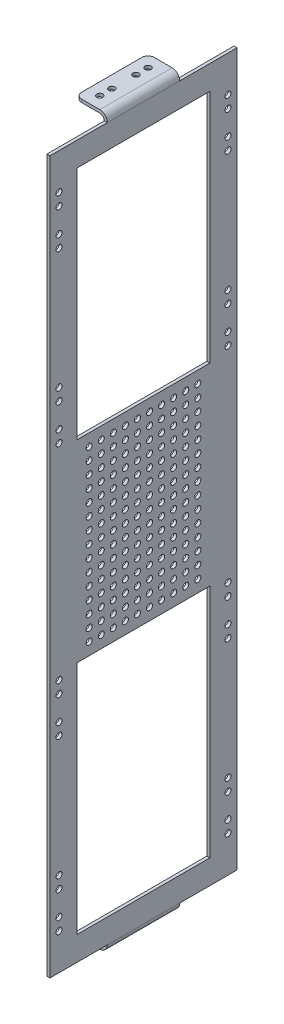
from build123d import *

# Parameters (mm, degrees)
SKETCH1_W              = 95.25
SKETCH1_H              = 374.65
MAINPLATEEXTRUDE_DEPTH = 1.5875
SKETCH4_W              = 69.85
SKETCH4_H              = 349.25
WALLOPENING_DEPTH      = 1.5875
SKETCH5_W              = 69.85
SKETCH5_H              = 101.6
SKETCH5_R              = 1.5875
ANTENNAEMOUNT_DEPTH    = 1.5875
BOSS_EXTRUDE1_DEPTH    = 19.05
MIRROR2_COPY_1_DEPTH   = 19.05
FILLET1_R              = 3.175
SKETCH8_R              = 1.5875
CUT_EXTRUDE1_DEPTH     = 382.905
SKETCH9_R              = 1.5875
CUT_EXTRUDE2_DEPTH     = 25.4
SKETCH10_W             = 1.5875
SKETCH10_H             = 374.65
BOSS_EXTRUDE2_DEPTH    = 1.5875


with BuildPart() as part:
    # Sketch1 → MainPlateExtrude (new body)
    with BuildSketch(Plane(origin=(0, 0, 0), x_dir=(0, 0, -1), z_dir=(1, 0, 0))):
        with Locations((47.625, 187.325)):
            Rectangle(SKETCH1_W, SKETCH1_H)
    extrude(amount=MAINPLATEEXTRUDE_DEPTH)

    # Sketch4 → WallOpening (cut)
    with BuildSketch(Plane.ZY):
        with Locations((-47.625, 187.325)):
            Rectangle(SKETCH4_W, SKETCH4_H)
    extrude(amount=-WALLOPENING_DEPTH, mode=Mode.SUBTRACT)

    # Sketch5 → AntennaeMount (add)
    with BuildSketch(Plane.ZY):
        with Locations((-47.625, 187.325)):
            Rectangle(SKETCH5_W, SKETCH5_H)
        with Locations((-76.2, 231.775)):
            Circle(SKETCH5_R, mode=Mode.SUBTRACT)
        with Locations((-69.85, 231.775)):
            Circle(SKETCH5_R, mode=Mode.SUBTRACT)
        with Locations((-63.5, 231.775)):
            Circle(SKETCH5_R, mode=Mode.SUBTRACT)
        with Locations((-57.15, 231.775)):
            Circle(SKETCH5_R, mode=Mode.SUBTRACT)
        with Locations((-50.8, 231.775)):
            Circle(SKETCH5_R, mode=Mode.SUBTRACT)
        with Locations((-44.45, 231.775)):
            Circle(SKETCH5_R, mode=Mode.SUBTRACT)
        with Locations((-38.1, 231.775)):
            Circle(SKETCH5_R, mode=Mode.SUBTRACT)
        with Locations((-31.75, 231.775)):
            Circle(SKETCH5_R, mode=Mode.SUBTRACT)
        with Locations((-25.4, 231.775)):
            Circle(SKETCH5_R, mode=Mode.SUBTRACT)
        with Locations((-19.05, 231.775)):
            Circle(SKETCH5_R, mode=Mode.SUBTRACT)
        with Locations((-69.85, 225.425)):
            Circle(SKETCH5_R, mode=Mode.SUBTRACT)
        with Locations((-63.5, 225.425)):
            Circle(SKETCH5_R, mode=Mode.SUBTRACT)
        with Locations((-57.15, 225.425)):
            Circle(SKETCH5_R, mode=Mode.SUBTRACT)
        with Locations((-50.8, 225.425)):
            Circle(SKETCH5_R, mode=Mode.SUBTRACT)
        with Locations((-44.45, 225.425)):
            Circle(SKETCH5_R, mode=Mode.SUBTRACT)
        with Locations((-38.1, 225.425)):
            Circle(SKETCH5_R, mode=Mode.SUBTRACT)
        with Locations((-31.75, 225.425)):
            Circle(SKETCH5_R, mode=Mode.SUBTRACT)
        with Locations((-25.4, 225.425)):
            Circle(SKETCH5_R, mode=Mode.SUBTRACT)
        with Locations((-19.05, 225.425)):
            Circle(SKETCH5_R, mode=Mode.SUBTRACT)
        with Locations((-69.85, 219.075)):
            Circle(SKETCH5_R, mode=Mode.SUBTRACT)
        with Locations((-63.5, 219.075)):
            Circle(SKETCH5_R, mode=Mode.SUBTRACT)
        with Locations((-57.15, 219.075)):
            Circle(SKETCH5_R, mode=Mode.SUBTRACT)
        with Locations((-50.8, 219.075)):
            Circle(SKETCH5_R, mode=Mode.SUBTRACT)
        with Locations((-44.45, 219.075)):
            Circle(SKETCH5_R, mode=Mode.SUBTRACT)
        with Locations((-38.1, 219.075)):
            Circle(SKETCH5_R, mode=Mode.SUBTRACT)
        with Locations((-31.75, 219.075)):
            Circle(SKETCH5_R, mode=Mode.SUBTRACT)
        with Locations((-25.4, 219.075)):
            Circle(SKETCH5_R, mode=Mode.SUBTRACT)
        with Locations((-19.05, 219.075)):
            Circle(SKETCH5_R, mode=Mode.SUBTRACT)
        with Locations((-69.85, 212.725)):
            Circle(SKETCH5_R, mode=Mode.SUBTRACT)
        with Locations((-63.5, 212.725)):
            Circle(SKETCH5_R, mode=Mode.SUBTRACT)
        with Locations((-57.15, 212.725)):
            Circle(SKETCH5_R, mode=Mode.SUBTRACT)
        with Locations((-50.8, 212.725)):
            Circle(SKETCH5_R, mode=Mode.SUBTRACT)
        with Locations((-44.45, 212.725)):
            Circle(SKETCH5_R, mode=Mode.SUBTRACT)
        with Locations((-38.1, 212.725)):
            Circle(SKETCH5_R, mode=Mode.SUBTRACT)
        with Locations((-31.75, 212.725)):
            Circle(SKETCH5_R, mode=Mode.SUBTRACT)
        with Locations((-25.4, 212.725)):
            Circle(SKETCH5_R, mode=Mode.SUBTRACT)
        with Locations((-19.05, 212.725)):
            Circle(SKETCH5_R, mode=Mode.SUBTRACT)
        with Locations((-69.85, 206.375)):
            Circle(SKETCH5_R, mode=Mode.SUBTRACT)
        with Locations((-63.5, 206.375)):
            Circle(SKETCH5_R, mode=Mode.SUBTRACT)
        with Locations((-57.15, 206.375)):
            Circle(SKETCH5_R, mode=Mode.SUBTRACT)
        with Locations((-50.8, 206.375)):
            Circle(SKETCH5_R, mode=Mode.SUBTRACT)
        with Locations((-44.45, 206.375)):
            Circle(SKETCH5_R, mode=Mode.SUBTRACT)
        with Locations((-38.1, 206.375)):
            Circle(SKETCH5_R, mode=Mode.SUBTRACT)
        with Locations((-31.75, 206.375)):
            Circle(SKETCH5_R, mode=Mode.SUBTRACT)
        with Locations((-25.4, 206.375)):
            Circle(SKETCH5_R, mode=Mode.SUBTRACT)
        with Locations((-19.05, 206.375)):
            Circle(SKETCH5_R, mode=Mode.SUBTRACT)
        with Locations((-69.85, 200.025)):
            Circle(SKETCH5_R, mode=Mode.SUBTRACT)
        with Locations((-63.5, 200.025)):
            Circle(SKETCH5_R, mode=Mode.SUBTRACT)
        with Locations((-57.15, 200.025)):
            Circle(SKETCH5_R, mode=Mode.SUBTRACT)
        with Locations((-50.8, 200.025)):
            Circle(SKETCH5_R, mode=Mode.SUBTRACT)
        with Locations((-44.45, 200.025)):
            Circle(SKETCH5_R, mode=Mode.SUBTRACT)
        with Locations((-38.1, 200.025)):
            Circle(SKETCH5_R, mode=Mode.SUBTRACT)
        with Locations((-31.75, 200.025)):
            Circle(SKETCH5_R, mode=Mode.SUBTRACT)
        with Locations((-25.4, 200.025)):
            Circle(SKETCH5_R, mode=Mode.SUBTRACT)
        with Locations((-19.05, 200.025)):
            Circle(SKETCH5_R, mode=Mode.SUBTRACT)
        with Locations((-69.85, 193.675)):
            Circle(SKETCH5_R, mode=Mode.SUBTRACT)
        with Locations((-63.5, 193.675)):
            Circle(SKETCH5_R, mode=Mode.SUBTRACT)
        with Locations((-57.15, 193.675)):
            Circle(SKETCH5_R, mode=Mode.SUBTRACT)
        with Locations((-50.8, 193.675)):
            Circle(SKETCH5_R, mode=Mode.SUBTRACT)
        with Locations((-44.45, 193.675)):
            Circle(SKETCH5_R, mode=Mode.SUBTRACT)
        with Locations((-38.1, 193.675)):
            Circle(SKETCH5_R, mode=Mode.SUBTRACT)
        with Locations((-31.75, 193.675)):
            Circle(SKETCH5_R, mode=Mode.SUBTRACT)
        with Locations((-25.4, 193.675)):
            Circle(SKETCH5_R, mode=Mode.SUBTRACT)
        with Locations((-19.05, 193.675)):
            Circle(SKETCH5_R, mode=Mode.SUBTRACT)
        with Locations((-69.85, 187.325)):
            Circle(SKETCH5_R, mode=Mode.SUBTRACT)
        with Locations((-63.5, 187.325)):
            Circle(SKETCH5_R, mode=Mode.SUBTRACT)
        with Locations((-57.15, 187.325)):
            Circle(SKETCH5_R, mode=Mode.SUBTRACT)
        with Locations((-50.8, 187.325)):
            Circle(SKETCH5_R, mode=Mode.SUBTRACT)
        with Locations((-44.45, 187.325)):
            Circle(SKETCH5_R, mode=Mode.SUBTRACT)
        with Locations((-38.1, 187.325)):
            Circle(SKETCH5_R, mode=Mode.SUBTRACT)
        with Locations((-31.75, 187.325)):
            Circle(SKETCH5_R, mode=Mode.SUBTRACT)
        with Locations((-25.4, 187.325)):
            Circle(SKETCH5_R, mode=Mode.SUBTRACT)
        with Locations((-19.05, 187.325)):
            Circle(SKETCH5_R, mode=Mode.SUBTRACT)
        with Locations((-69.85, 180.975)):
            Circle(SKETCH5_R, mode=Mode.SUBTRACT)
        with Locations((-63.5, 180.975)):
            Circle(SKETCH5_R, mode=Mode.SUBTRACT)
        with Locations((-57.15, 180.975)):
            Circle(SKETCH5_R, mode=Mode.SUBTRACT)
        with Locations((-50.8, 180.975)):
            Circle(SKETCH5_R, mode=Mode.SUBTRACT)
        with Locations((-44.45, 180.975)):
            Circle(SKETCH5_R, mode=Mode.SUBTRACT)
        with Locations((-38.1, 180.975)):
            Circle(SKETCH5_R, mode=Mode.SUBTRACT)
        with Locations((-31.75, 180.975)):
            Circle(SKETCH5_R, mode=Mode.SUBTRACT)
        with Locations((-25.4, 180.975)):
            Circle(SKETCH5_R, mode=Mode.SUBTRACT)
        with Locations((-19.05, 180.975)):
            Circle(SKETCH5_R, mode=Mode.SUBTRACT)
        with Locations((-69.85, 174.625)):
            Circle(SKETCH5_R, mode=Mode.SUBTRACT)
        with Locations((-63.5, 174.625)):
            Circle(SKETCH5_R, mode=Mode.SUBTRACT)
        with Locations((-57.15, 174.625)):
            Circle(SKETCH5_R, mode=Mode.SUBTRACT)
        with Locations((-50.8, 174.625)):
            Circle(SKETCH5_R, mode=Mode.SUBTRACT)
        with Locations((-44.45, 174.625)):
            Circle(SKETCH5_R, mode=Mode.SUBTRACT)
        with Locations((-38.1, 174.625)):
            Circle(SKETCH5_R, mode=Mode.SUBTRACT)
        with Locations((-31.75, 174.625)):
            Circle(SKETCH5_R, mode=Mode.SUBTRACT)
        with Locations((-25.4, 174.625)):
            Circle(SKETCH5_R, mode=Mode.SUBTRACT)
        with Locations((-19.05, 174.625)):
            Circle(SKETCH5_R, mode=Mode.SUBTRACT)
        with Locations((-69.85, 168.275)):
            Circle(SKETCH5_R, mode=Mode.SUBTRACT)
        with Locations((-63.5, 168.275)):
            Circle(SKETCH5_R, mode=Mode.SUBTRACT)
        with Locations((-57.15, 168.275)):
            Circle(SKETCH5_R, mode=Mode.SUBTRACT)
        with Locations((-50.8, 168.275)):
            Circle(SKETCH5_R, mode=Mode.SUBTRACT)
        with Locations((-44.45, 168.275)):
            Circle(SKETCH5_R, mode=Mode.SUBTRACT)
        with Locations((-38.1, 168.275)):
            Circle(SKETCH5_R, mode=Mode.SUBTRACT)
        with Locations((-31.75, 168.275)):
            Circle(SKETCH5_R, mode=Mode.SUBTRACT)
        with Locations((-25.4, 168.275)):
            Circle(SKETCH5_R, mode=Mode.SUBTRACT)
        with Locations((-19.05, 168.275)):
            Circle(SKETCH5_R, mode=Mode.SUBTRACT)
        with Locations((-69.85, 161.925)):
            Circle(SKETCH5_R, mode=Mode.SUBTRACT)
        with Locations((-63.5, 161.925)):
            Circle(SKETCH5_R, mode=Mode.SUBTRACT)
        with Locations((-57.15, 161.925)):
            Circle(SKETCH5_R, mode=Mode.SUBTRACT)
        with Locations((-50.8, 161.925)):
            Circle(SKETCH5_R, mode=Mode.SUBTRACT)
        with Locations((-44.45, 161.925)):
            Circle(SKETCH5_R, mode=Mode.SUBTRACT)
        with Locations((-38.1, 161.925)):
            Circle(SKETCH5_R, mode=Mode.SUBTRACT)
        with Locations((-31.75, 161.925)):
            Circle(SKETCH5_R, mode=Mode.SUBTRACT)
        with Locations((-25.4, 161.925)):
            Circle(SKETCH5_R, mode=Mode.SUBTRACT)
        with Locations((-19.05, 161.925)):
            Circle(SKETCH5_R, mode=Mode.SUBTRACT)
        with Locations((-69.85, 155.575)):
            Circle(SKETCH5_R, mode=Mode.SUBTRACT)
        with Locations((-63.5, 155.575)):
            Circle(SKETCH5_R, mode=Mode.SUBTRACT)
        with Locations((-57.15, 155.575)):
            Circle(SKETCH5_R, mode=Mode.SUBTRACT)
        with Locations((-50.8, 155.575)):
            Circle(SKETCH5_R, mode=Mode.SUBTRACT)
        with Locations((-44.45, 155.575)):
            Circle(SKETCH5_R, mode=Mode.SUBTRACT)
        with Locations((-38.1, 155.575)):
            Circle(SKETCH5_R, mode=Mode.SUBTRACT)
        with Locations((-31.75, 155.575)):
            Circle(SKETCH5_R, mode=Mode.SUBTRACT)
        with Locations((-25.4, 155.575)):
            Circle(SKETCH5_R, mode=Mode.SUBTRACT)
        with Locations((-19.05, 155.575)):
            Circle(SKETCH5_R, mode=Mode.SUBTRACT)
        with Locations((-69.85, 149.225)):
            Circle(SKETCH5_R, mode=Mode.SUBTRACT)
        with Locations((-63.5, 149.225)):
            Circle(SKETCH5_R, mode=Mode.SUBTRACT)
        with Locations((-57.15, 149.225)):
            Circle(SKETCH5_R, mode=Mode.SUBTRACT)
        with Locations((-50.8, 149.225)):
            Circle(SKETCH5_R, mode=Mode.SUBTRACT)
        with Locations((-44.45, 149.225)):
            Circle(SKETCH5_R, mode=Mode.SUBTRACT)
        with Locations((-38.1, 149.225)):
            Circle(SKETCH5_R, mode=Mode.SUBTRACT)
        with Locations((-31.75, 149.225)):
            Circle(SKETCH5_R, mode=Mode.SUBTRACT)
        with Locations((-25.4, 149.225)):
            Circle(SKETCH5_R, mode=Mode.SUBTRACT)
        with Locations((-19.05, 149.225)):
            Circle(SKETCH5_R, mode=Mode.SUBTRACT)
        with Locations((-69.85, 142.875)):
            Circle(SKETCH5_R, mode=Mode.SUBTRACT)
        with Locations((-63.5, 142.875)):
            Circle(SKETCH5_R, mode=Mode.SUBTRACT)
        with Locations((-57.15, 142.875)):
            Circle(SKETCH5_R, mode=Mode.SUBTRACT)
        with Locations((-50.8, 142.875)):
            Circle(SKETCH5_R, mode=Mode.SUBTRACT)
        with Locations((-44.45, 142.875)):
            Circle(SKETCH5_R, mode=Mode.SUBTRACT)
        with Locations((-38.1, 142.875)):
            Circle(SKETCH5_R, mode=Mode.SUBTRACT)
        with Locations((-31.75, 142.875)):
            Circle(SKETCH5_R, mode=Mode.SUBTRACT)
        with Locations((-25.4, 142.875)):
            Circle(SKETCH5_R, mode=Mode.SUBTRACT)
        with Locations((-19.05, 142.875)):
            Circle(SKETCH5_R, mode=Mode.SUBTRACT)
        with Locations((-76.2, 225.425)):
            Circle(SKETCH5_R, mode=Mode.SUBTRACT)
        with Locations((-76.2, 219.075)):
            Circle(SKETCH5_R, mode=Mode.SUBTRACT)
        with Locations((-76.2, 212.725)):
            Circle(SKETCH5_R, mode=Mode.SUBTRACT)
        with Locations((-76.2, 206.375)):
            Circle(SKETCH5_R, mode=Mode.SUBTRACT)
        with Locations((-76.2, 200.025)):
            Circle(SKETCH5_R, mode=Mode.SUBTRACT)
        with Locations((-76.2, 193.675)):
            Circle(SKETCH5_R, mode=Mode.SUBTRACT)
        with Locations((-76.2, 187.325)):
            Circle(SKETCH5_R, mode=Mode.SUBTRACT)
        with Locations((-76.2, 180.975)):
            Circle(SKETCH5_R, mode=Mode.SUBTRACT)
        with Locations((-76.2, 174.625)):
            Circle(SKETCH5_R, mode=Mode.SUBTRACT)
        with Locations((-76.2, 168.275)):
            Circle(SKETCH5_R, mode=Mode.SUBTRACT)
        with Locations((-76.2, 161.925)):
            Circle(SKETCH5_R, mode=Mode.SUBTRACT)
        with Locations((-76.2, 155.575)):
            Circle(SKETCH5_R, mode=Mode.SUBTRACT)
        with Locations((-76.2, 149.225)):
            Circle(SKETCH5_R, mode=Mode.SUBTRACT)
        with Locations((-76.2, 142.875)):
            Circle(SKETCH5_R, mode=Mode.SUBTRACT)
    extrude(amount=-ANTENNAEMOUNT_DEPTH)

    # Sketch7 → Boss-Extrude1 (add)
    with BuildSketch(Plane(origin=(0, 0, -47.625), x_dir=(-1, 0, 0), z_dir=(0, 0, -1))):
        with BuildLine():
            Line((0, 374.65), (-1.5875, 374.65))
            ThreePointArc((-1.5875, 374.65), (-0.425080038, 377.456330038), (2.38125, 378.61875))
            Line((2.38125, 378.61875), (15.08125, 378.61875))
            Line((15.08125, 378.61875), (15.08125, 377.03125))
            Line((15.08125, 377.03125), (2.38125, 377.03125))
            ThreePointArc((2.38125, 377.03125), (0.697451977, 376.333798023), (0, 374.65))
        make_face()
    boss_extrude1 = extrude(amount=BOSS_EXTRUDE1_DEPTH)

    # Mirror1: Boss-Extrude1 across plane
    add(boss_extrude1.mirror(Plane(origin=(0, 0, -47.625), x_dir=(1, 0, 0), z_dir=(0, 0, -1))))

    # Mirror2: Boss-Extrude1 across plane
    add(boss_extrude1.mirror(Plane.ZX.offset(187.325)))

    # Mirror2 copy 1 sketch → Mirror2 copy 1 (add)
    with BuildSketch(Plane(origin=(0, 374.65, -47.625), x_dir=(-1, 0, 0), z_dir=(0, 0, 1))):
        with BuildLine():
            Line((0, 374.65), (-1.5875, 374.65))
            ThreePointArc((-1.5875, 374.65), (-0.425080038, 377.456330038), (2.38125, 378.61875))
            Line((2.38125, 378.61875), (15.08125, 378.61875))
            Line((15.08125, 378.61875), (15.08125, 377.03125))
            Line((15.08125, 377.03125), (2.38125, 377.03125))
            ThreePointArc((2.38125, 377.03125), (0.697451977, 376.333798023), (0, 374.65))
        make_face()
    extrude(amount=MIRROR2_COPY_1_DEPTH)

    # Fillet1
    fillet1_edges = [part.edges().sort_by_distance(p)[0] for p in [
        (-15.08125, 377.825, -66.675),
        (-15.08125, 377.825, -28.575),
        (-15.08125, -3.175, -66.675),
        (-15.08125, -3.175, -28.575),
    ]]
    fillet(fillet1_edges, radius=FILLET1_R)

    # Sketch8 → Cut-Extrude1 (cut)
    with BuildSketch(Plane(origin=(0, 378.61875, 0), x_dir=(1, 0, 0), z_dir=(0, 1, 0))):
        with Locations(Location((-8.73125, 34.925, 0), (0, 0, 270))):
            Circle(SKETCH8_R)
        with Locations(Location((-8.73125, 41.275, 0), (0, 0, 270))):
            Circle(SKETCH8_R)
        with Locations(Location((-8.73125, 53.975, 0), (0, 0, 270))):
            Circle(SKETCH8_R)
        with Locations(Location((-8.73125, 60.325, 0), (0, 0, 270))):
            Circle(SKETCH8_R)
    extrude(amount=-CUT_EXTRUDE1_DEPTH, mode=Mode.SUBTRACT)

    # Sketch9 → Cut-Extrude2 (cut)
    with BuildSketch(Plane(origin=(1.5875, 0, 0), x_dir=(0, 0, -1), z_dir=(1, 0, 0))):
        with Locations((3.175, 355.6)):
            Circle(SKETCH9_R)
        with Locations((3.175, 349.25)):
            Circle(SKETCH9_R)
        with Locations((3.175, 336.55)):
            Circle(SKETCH9_R)
        with Locations((3.175, 330.2)):
            Circle(SKETCH9_R)
        with Locations((3.175, 247.65)):
            Circle(SKETCH9_R)
        with Locations((3.175, 241.3)):
            Circle(SKETCH9_R)
        with Locations((3.175, 266.7)):
            Circle(SKETCH9_R)
        with Locations((3.175, 260.35)):
            Circle(SKETCH9_R)
        with Locations((3.175, 127)):
            Circle(SKETCH9_R)
        with Locations((3.175, 133.35)):
            Circle(SKETCH9_R)
        with Locations((3.175, 107.95)):
            Circle(SKETCH9_R)
        with Locations((3.175, 114.3)):
            Circle(SKETCH9_R)
        with Locations((3.175, 25.4)):
            Circle(SKETCH9_R)
        with Locations((3.175, 19.05)):
            Circle(SKETCH9_R)
        with Locations((3.175, 38.1)):
            Circle(SKETCH9_R)
        with Locations((3.175, 44.45)):
            Circle(SKETCH9_R)
    cut_extrude2 = extrude(amount=-CUT_EXTRUDE2_DEPTH, mode=Mode.SUBTRACT)

    # Mirror3: Cut-Extrude2 across plane
    add(cut_extrude2.mirror(Plane.XY.offset(-47.625)), mode=Mode.SUBTRACT)

    # Sketch10 → Boss-Extrude2 (add)
    with BuildSketch(Plane.XY):
        with Locations((0.79375, 187.325)):
            Rectangle(SKETCH10_W, SKETCH10_H)
    boss_extrude2 = extrude(amount=BOSS_EXTRUDE2_DEPTH)

    # Mirror4: Boss-Extrude2 across plane
    add(boss_extrude2.mirror(Plane.XY.offset(-47.625)))


solid = part.part
